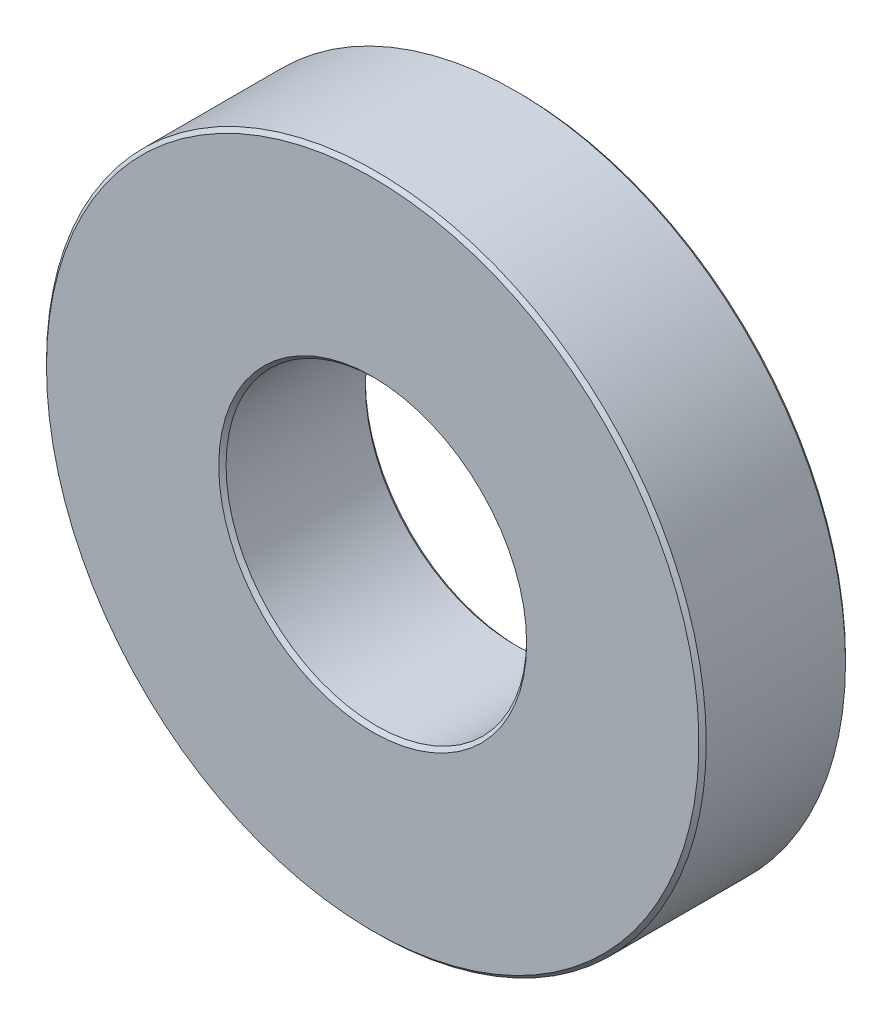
ISO-10303-21;
HEADER;
FILE_DESCRIPTION(('STEP AP214'),'2;1');
FILE_NAME('part.step','',(''),(''),'','','');
FILE_SCHEMA(('AUTOMOTIVE_DESIGN { 1 0 10303 214 1 1 1 1 }'));
ENDSEC;
DATA;
#1=APPLICATION_CONTEXT('core data for automotive mechanical design processes');
#2=APPLICATION_PROTOCOL_DEFINITION('international standard','automotive_design',2000,#1);
#3=PRODUCT_CONTEXT('',#1,'mechanical');
#4=PRODUCT('Part','Part','',(#3));
#5=PRODUCT_RELATED_PRODUCT_CATEGORY('part','',(#4));
#6=PRODUCT_DEFINITION_FORMATION('','',#4);
#7=PRODUCT_DEFINITION_CONTEXT('part definition',#1,'design');
#8=PRODUCT_DEFINITION('design','',#6,#7);
#9=PRODUCT_DEFINITION_SHAPE('','',#8);
#10=(LENGTH_UNIT() NAMED_UNIT(*) SI_UNIT(.MILLI.,.METRE.));
#11=(NAMED_UNIT(*) PLANE_ANGLE_UNIT() SI_UNIT($,.RADIAN.));
#12=(NAMED_UNIT(*) SI_UNIT($,.STERADIAN.) SOLID_ANGLE_UNIT());
#13=UNCERTAINTY_MEASURE_WITH_UNIT(LENGTH_MEASURE(1.E-05),#10,'distance_accuracy_value','');
#14=(GEOMETRIC_REPRESENTATION_CONTEXT(3) GLOBAL_UNCERTAINTY_ASSIGNED_CONTEXT((#13)) GLOBAL_UNIT_ASSIGNED_CONTEXT((#10,
#11,#12)) REPRESENTATION_CONTEXT('',''));
#15=CARTESIAN_POINT('',(0.,0.,0.));
#16=DIRECTION('',(0.,0.,1.));
#17=DIRECTION('',(1.,0.,0.));
#18=AXIS2_PLACEMENT_3D('',#15,#16,#17);
#19=CARTESIAN_POINT('',(-0.964630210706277,0.,0.));
#20=DIRECTION('',(0.,0.,1.));
#21=DIRECTION('',(1.,0.,0.));
#22=AXIS2_PLACEMENT_3D('',#19,#20,#21);
#23=CYLINDRICAL_SURFACE('',#22,4.1);
#24=CARTESIAN_POINT('',(-0.964630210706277,0.,0.100000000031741));
#25=DIRECTION('',(0.,0.,-1.));
#26=DIRECTION('',(-1.,0.,0.));
#27=AXIS2_PLACEMENT_3D('',#24,#25,#26);
#28=CIRCLE('',#27,4.10000000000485);
#29=CARTESIAN_POINT('',(-5.06463021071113,0.,0.100000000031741));
#30=VERTEX_POINT('',#29);
#31=EDGE_CURVE('E34',#30,#30,#28,.T.);
#32=ORIENTED_EDGE('',*,*,#31,.T.);
#33=EDGE_LOOP('',(#32));
#34=FACE_BOUND('',#33,.T.);
#35=CARTESIAN_POINT('',(-0.964630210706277,0.,3.89999999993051));
#36=DIRECTION('',(0.,0.,1.));
#37=DIRECTION('',(-1.,0.,0.));
#38=AXIS2_PLACEMENT_3D('',#35,#36,#37);
#39=CIRCLE('',#38,4.1000000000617);
#40=CARTESIAN_POINT('',(-5.06463021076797,0.,3.89999999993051));
#41=VERTEX_POINT('',#40);
#42=EDGE_CURVE('E37',#41,#41,#39,.T.);
#43=ORIENTED_EDGE('',*,*,#42,.T.);
#44=EDGE_LOOP('',(#43));
#45=FACE_BOUND('',#44,.T.);
#46=ADVANCED_FACE('F15',(#34,#45),#23,.F.);
#47=CARTESIAN_POINT('',(-0.964630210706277,0.,3.99999999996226));
#48=DIRECTION('',(0.,0.,1.));
#49=DIRECTION('',(1.,0.,0.));
#50=AXIS2_PLACEMENT_3D('',#47,#48,#49);
#51=CONICAL_SURFACE('',#50,4.19999999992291,0.785398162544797);
#52=CARTESIAN_POINT('',(-0.964630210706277,0.,4.0000000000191));
#53=DIRECTION('',(0.,0.,1.));
#54=DIRECTION('',(1.,0.,0.));
#55=AXIS2_PLACEMENT_3D('',#52,#53,#54);
#56=CIRCLE('',#55,4.19999999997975);
#57=CARTESIAN_POINT('',(3.23536978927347,0.,4.0000000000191));
#58=VERTEX_POINT('',#57);
#59=EDGE_CURVE('E18',#58,#58,#56,.T.);
#60=ORIENTED_EDGE('',*,*,#59,.T.);
#61=EDGE_LOOP('',(#60));
#62=FACE_BOUND('',#61,.T.);
#63=ORIENTED_EDGE('',*,*,#42,.F.);
#64=EDGE_LOOP('',(#63));
#65=FACE_BOUND('',#64,.T.);
#66=ADVANCED_FACE('F55',(#62,#65),#51,.F.);
#67=CARTESIAN_POINT('',(-0.964630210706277,0.,0.));
#68=DIRECTION('',(0.,0.,-1.));
#69=DIRECTION('',(-1.,0.,0.));
#70=AXIS2_PLACEMENT_3D('',#67,#68,#69);
#71=CONICAL_SURFACE('',#70,4.19999999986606,0.78539816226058);
#72=CARTESIAN_POINT('',(-0.964630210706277,0.,-5.6843418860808E-11));
#73=DIRECTION('',(0.,0.,-1.));
#74=DIRECTION('',(-1.,0.,0.));
#75=AXIS2_PLACEMENT_3D('',#72,#73,#74);
#76=CIRCLE('',#75,4.19999999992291);
#77=CARTESIAN_POINT('',(-5.16463021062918,0.,-5.6843418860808E-11));
#78=VERTEX_POINT('',#77);
#79=EDGE_CURVE('E48',#78,#78,#76,.F.);
#80=ORIENTED_EDGE('',*,*,#79,.F.);
#81=EDGE_LOOP('',(#80));
#82=FACE_BOUND('',#81,.T.);
#83=ORIENTED_EDGE('',*,*,#31,.F.);
#84=EDGE_LOOP('',(#83));
#85=FACE_BOUND('',#84,.T.);
#86=ADVANCED_FACE('F62',(#82,#85),#71,.F.);
#87=CARTESIAN_POINT('',(-0.964630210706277,0.,4.));
#88=DIRECTION('',(0.,0.,-1.));
#89=DIRECTION('',(-1.,0.,0.));
#90=AXIS2_PLACEMENT_3D('',#87,#88,#89);
#91=PLANE('',#90);
#92=ORIENTED_EDGE('',*,*,#59,.F.);
#93=EDGE_LOOP('',(#92));
#94=FACE_BOUND('',#93,.T.);
#95=CARTESIAN_POINT('',(-0.964630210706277,0.,4.00000000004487));
#96=DIRECTION('',(0.,0.,-1.));
#97=DIRECTION('',(-1.,0.,0.));
#98=AXIS2_PLACEMENT_3D('',#95,#96,#97);
#99=CIRCLE('',#98,8.90000000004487);
#100=CARTESIAN_POINT('',(-9.86463021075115,0.,4.00000000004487));
#101=VERTEX_POINT('',#100);
#102=EDGE_CURVE('E46',#101,#101,#99,.T.);
#103=ORIENTED_EDGE('',*,*,#102,.F.);
#104=EDGE_LOOP('',(#103));
#105=FACE_BOUND('',#104,.T.);
#106=ADVANCED_FACE('F58',(#94,#105),#91,.F.);
#107=CARTESIAN_POINT('',(-0.964630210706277,0.,0.));
#108=DIRECTION('',(0.,0.,-1.));
#109=DIRECTION('',(-1.,0.,0.));
#110=AXIS2_PLACEMENT_3D('',#107,#108,#109);
#111=PLANE('',#110);
#112=ORIENTED_EDGE('',*,*,#79,.T.);
#113=EDGE_LOOP('',(#112));
#114=FACE_BOUND('',#113,.T.);
#115=CARTESIAN_POINT('',(-0.964630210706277,0.,-4.48723225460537E-11));
#116=DIRECTION('',(0.,0.,1.));
#117=DIRECTION('',(1.,0.,0.));
#118=AXIS2_PLACEMENT_3D('',#115,#116,#117);
#119=CIRCLE('',#118,8.90000000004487);
#120=CARTESIAN_POINT('',(7.9353697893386,0.,-4.48723225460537E-11));
#121=VERTEX_POINT('',#120);
#122=EDGE_CURVE('E27',#121,#121,#119,.T.);
#123=ORIENTED_EDGE('',*,*,#122,.F.);
#124=EDGE_LOOP('',(#123));
#125=FACE_BOUND('',#124,.T.);
#126=ADVANCED_FACE('F61',(#114,#125),#111,.T.);
#127=CARTESIAN_POINT('',(-0.964630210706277,0.,3.89999999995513));
#128=DIRECTION('',(0.,0.,-1.));
#129=DIRECTION('',(-1.,0.,0.));
#130=AXIS2_PLACEMENT_3D('',#127,#128,#129);
#131=CONICAL_SURFACE('',#130,8.99999999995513,0.785398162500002);
#132=CARTESIAN_POINT('',(-0.964630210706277,0.,3.9));
#133=DIRECTION('',(0.,0.,1.));
#134=DIRECTION('',(1.,0.,0.));
#135=AXIS2_PLACEMENT_3D('',#132,#133,#134);
#136=CIRCLE('',#135,9.);
#137=CARTESIAN_POINT('',(8.03536978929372,0.,3.9));
#138=VERTEX_POINT('',#137);
#139=EDGE_CURVE('E22',#138,#138,#136,.F.);
#140=ORIENTED_EDGE('',*,*,#139,.F.);
#141=EDGE_LOOP('',(#140));
#142=FACE_BOUND('',#141,.T.);
#143=ORIENTED_EDGE('',*,*,#102,.T.);
#144=EDGE_LOOP('',(#143));
#145=FACE_BOUND('',#144,.T.);
#146=ADVANCED_FACE('F66',(#142,#145),#131,.T.);
#147=CARTESIAN_POINT('',(-0.964630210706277,0.,0.100000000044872));
#148=DIRECTION('',(0.,0.,1.));
#149=DIRECTION('',(1.,0.,0.));
#150=AXIS2_PLACEMENT_3D('',#147,#148,#149);
#151=CONICAL_SURFACE('',#150,8.99999999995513,0.785398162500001);
#152=ORIENTED_EDGE('',*,*,#122,.T.);
#153=EDGE_LOOP('',(#152));
#154=FACE_BOUND('',#153,.T.);
#155=CARTESIAN_POINT('',(-0.964630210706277,0.,0.1));
#156=DIRECTION('',(0.,0.,1.));
#157=DIRECTION('',(1.,0.,0.));
#158=AXIS2_PLACEMENT_3D('',#155,#156,#157);
#159=CIRCLE('',#158,9.);
#160=CARTESIAN_POINT('',(8.03536978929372,0.,0.1));
#161=VERTEX_POINT('',#160);
#162=EDGE_CURVE('E10',#161,#161,#159,.T.);
#163=ORIENTED_EDGE('',*,*,#162,.F.);
#164=EDGE_LOOP('',(#163));
#165=FACE_BOUND('',#164,.T.);
#166=ADVANCED_FACE('F68',(#154,#165),#151,.T.);
#167=CARTESIAN_POINT('',(-0.964630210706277,0.,0.));
#168=DIRECTION('',(0.,0.,1.));
#169=DIRECTION('',(1.,0.,0.));
#170=AXIS2_PLACEMENT_3D('',#167,#168,#169);
#171=CYLINDRICAL_SURFACE('',#170,9.);
#172=ORIENTED_EDGE('',*,*,#162,.T.);
#173=EDGE_LOOP('',(#172));
#174=FACE_BOUND('',#173,.T.);
#175=ORIENTED_EDGE('',*,*,#139,.T.);
#176=EDGE_LOOP('',(#175));
#177=FACE_BOUND('',#176,.T.);
#178=ADVANCED_FACE('F76',(#174,#177),#171,.T.);
#179=CLOSED_SHELL('',(#46,#66,#86,#106,#126,#146,#166,#178));
#180=MANIFOLD_SOLID_BREP('B1',#179);
#181=ADVANCED_BREP_SHAPE_REPRESENTATION('',(#18,#180),#14);
#182=SHAPE_DEFINITION_REPRESENTATION(#9,#181);
ENDSEC;
END-ISO-10303-21;
